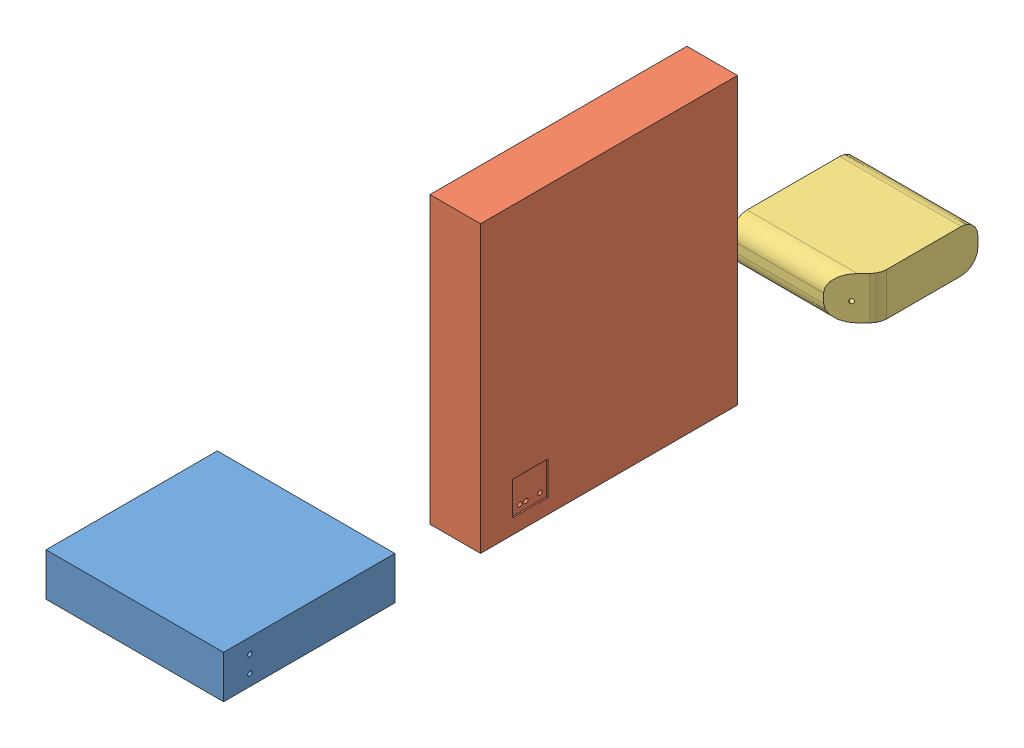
SolidWorks assembly components.SLDASM, configuration Default (file format 13000). Lengths in mm.
Overall size (316 508 1342.4).
3 component instances, 3 part files, 6 mates.
Components (placement in the parent):
- Input_1-1: Input_1.SLDPRT [Default] at origin size (316 76.2 304.8)
- TV-1: TV.SLDPRT [Default] at (0 0 -457.2) x (0 0 -1) z (1 0 0) size (457.2 508 90)
- Input_2-1: Input_2.SLDPRT [Default] at (0 0 -1117.6) size (216 76.2 224.8)
Mates (geometry in assembly coordinates):
- Coincident1: coincident: plane of Input_2-1 through (-216 0 -1117.6) normal (0 -1 0); plane of TV-1 through (-90 0 -457.2) normal (0 -1 0)
- Coincident2: coincident: plane of Input_1-1 through (0 76.2 0) normal (1 0 0); plane of Input_2-1 through (0 76.2 -1117.6) normal (1 0 0)
- Distance1: distance = 152.4 mm: plane of Input_1-1 through (-316 0 -304.8) normal (0 0 -1); plane of TV-1 through (-90 0 -457.2) normal (0 0 1)
- Coincident5: coincident: plane of Input_1-1 through (-316 0 0) normal (0 -1 0); plane of TV-1 through (-90 0 -457.2) normal (0 -1 0)
- Coincident6: coincident: plane of Input_1-1 through (0 76.2 0) normal (1 0 0); plane of TV-1 through (0 508 -457.2) normal (1 0 0)
- Distance2: distance = 203.2 mm: plane of TV-1 through (-90 0 -914.4) normal (0 0 -1); plane of Input_2-1 through (-216 0 -1117.6) normal (0 0 1)
